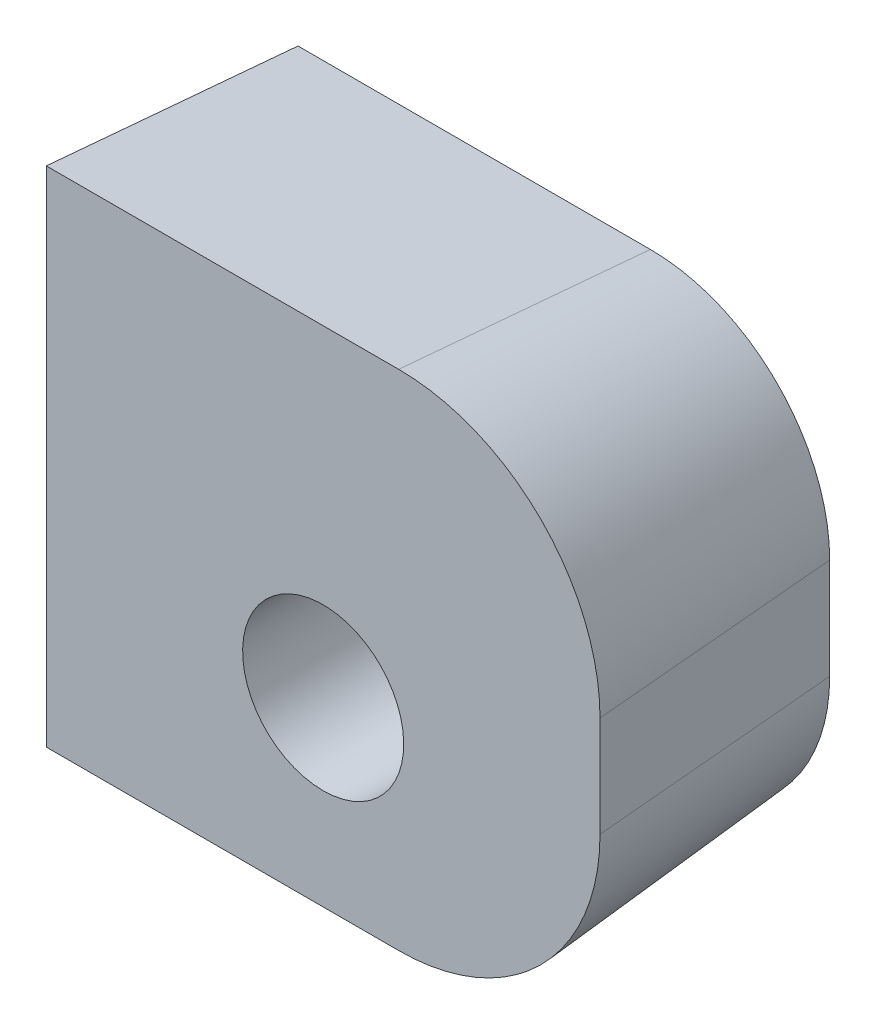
ISO-10303-21;
HEADER;
FILE_DESCRIPTION(('STEP AP214'),'2;1');
FILE_NAME('part.step','',(''),(''),'','','');
FILE_SCHEMA(('AUTOMOTIVE_DESIGN { 1 0 10303 214 1 1 1 1 }'));
ENDSEC;
DATA;
#1=APPLICATION_CONTEXT('core data for automotive mechanical design processes');
#2=APPLICATION_PROTOCOL_DEFINITION('international standard','automotive_design',2000,#1);
#3=PRODUCT_CONTEXT('',#1,'mechanical');
#4=PRODUCT('Part','Part','',(#3));
#5=PRODUCT_RELATED_PRODUCT_CATEGORY('part','',(#4));
#6=PRODUCT_DEFINITION_FORMATION('','',#4);
#7=PRODUCT_DEFINITION_CONTEXT('part definition',#1,'design');
#8=PRODUCT_DEFINITION('design','',#6,#7);
#9=PRODUCT_DEFINITION_SHAPE('','',#8);
#10=(LENGTH_UNIT() NAMED_UNIT(*) SI_UNIT(.MILLI.,.METRE.));
#11=(NAMED_UNIT(*) PLANE_ANGLE_UNIT() SI_UNIT($,.RADIAN.));
#12=(NAMED_UNIT(*) SI_UNIT($,.STERADIAN.) SOLID_ANGLE_UNIT());
#13=UNCERTAINTY_MEASURE_WITH_UNIT(LENGTH_MEASURE(1.E-05),#10,'distance_accuracy_value','');
#14=(GEOMETRIC_REPRESENTATION_CONTEXT(3) GLOBAL_UNCERTAINTY_ASSIGNED_CONTEXT((#13)) GLOBAL_UNIT_ASSIGNED_CONTEXT((#10,
#11,#12)) REPRESENTATION_CONTEXT('',''));
#15=CARTESIAN_POINT('',(0.,0.,0.));
#16=DIRECTION('',(0.,0.,1.));
#17=DIRECTION('',(1.,0.,0.));
#18=AXIS2_PLACEMENT_3D('',#15,#16,#17);
#19=CARTESIAN_POINT('',(-25.1242782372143,20.1001640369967,-2.51250000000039));
#20=DIRECTION('',(0.,0.,-1.));
#21=DIRECTION('',(-1.,0.,0.));
#22=AXIS2_PLACEMENT_3D('',#19,#20,#21);
#23=PLANE('',#22);
#24=DIRECTION('',(0.,1.,0.));
#25=VECTOR('',#24,1.);
#26=CARTESIAN_POINT('',(-19.8165935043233,20.1001640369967,-2.51250000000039));
#27=LINE('',#26,#25);
#28=CARTESIAN_POINT('',(-19.8165935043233,23.1151640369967,-2.51250000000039));
#29=VERTEX_POINT('',#28);
#30=CARTESIAN_POINT('',(-19.8165935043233,22.1101640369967,-2.51250000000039));
#31=VERTEX_POINT('',#30);
#32=EDGE_CURVE('E109',#29,#31,#27,.F.);
#33=ORIENTED_EDGE('',*,*,#32,.T.);
#34=CARTESIAN_POINT('',(-21.6067782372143,22.1101640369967,-2.51250000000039));
#35=DIRECTION('',(0.,0.,-1.));
#36=DIRECTION('',(0.,-1.,0.));
#37=AXIS2_PLACEMENT_3D('',#34,#35,#36);
#38=CIRCLE('',#37,1.79018473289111);
#39=CARTESIAN_POINT('',(-21.6067782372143,20.3199793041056,-2.51250000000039));
#40=VERTEX_POINT('',#39);
#41=EDGE_CURVE('E104',#31,#40,#38,.T.);
#42=ORIENTED_EDGE('',*,*,#41,.T.);
#43=DIRECTION('',(1.,0.,0.));
#44=VECTOR('',#43,1.);
#45=CARTESIAN_POINT('',(-25.1242782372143,20.3199793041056,-2.51250000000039));
#46=LINE('',#45,#44);
#47=CARTESIAN_POINT('',(-25.1242782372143,20.3199793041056,-2.51250000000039));
#48=VERTEX_POINT('',#47);
#49=EDGE_CURVE('E108',#40,#48,#46,.F.);
#50=ORIENTED_EDGE('',*,*,#49,.T.);
#51=DIRECTION('',(0.,1.,0.));
#52=VECTOR('',#51,1.);
#53=CARTESIAN_POINT('',(-25.1242782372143,20.1001640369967,-2.51250000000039));
#54=LINE('',#53,#52);
#55=CARTESIAN_POINT('',(-25.1242782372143,24.9053487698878,-2.51250000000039));
#56=VERTEX_POINT('',#55);
#57=EDGE_CURVE('E117',#48,#56,#54,.T.);
#58=ORIENTED_EDGE('',*,*,#57,.T.);
#59=DIRECTION('',(-1.,0.,0.));
#60=VECTOR('',#59,1.);
#61=CARTESIAN_POINT('',(-25.1242782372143,24.9053487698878,-2.51250000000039));
#62=LINE('',#61,#60);
#63=CARTESIAN_POINT('',(-21.6067782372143,24.9053487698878,-2.51250000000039));
#64=VERTEX_POINT('',#63);
#65=EDGE_CURVE('E115',#56,#64,#62,.F.);
#66=ORIENTED_EDGE('',*,*,#65,.T.);
#67=CARTESIAN_POINT('',(-21.6067782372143,23.1151640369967,-2.51250000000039));
#68=DIRECTION('',(0.,0.,-1.));
#69=DIRECTION('',(0.,-1.,0.));
#70=AXIS2_PLACEMENT_3D('',#67,#68,#69);
#71=CIRCLE('',#70,1.79018473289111);
#72=EDGE_CURVE('E87',#64,#29,#71,.T.);
#73=ORIENTED_EDGE('',*,*,#72,.T.);
#74=EDGE_LOOP('',(#33,#42,#50,#58,#66,#73));
#75=FACE_BOUND('',#74,.T.);
#76=CARTESIAN_POINT('',(-22.3605282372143,21.9091640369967,-2.51250000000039));
#77=DIRECTION('',(0.,0.,-1.));
#78=DIRECTION('',(0.,-1.,0.));
#79=AXIS2_PLACEMENT_3D('',#76,#77,#78);
#80=CIRCLE('',#79,0.804);
#81=CARTESIAN_POINT('',(-22.3605282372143,21.1051640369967,-2.51250000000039));
#82=VERTEX_POINT('',#81);
#83=EDGE_CURVE('E20',#82,#82,#80,.F.);
#84=ORIENTED_EDGE('',*,*,#83,.T.);
#85=EDGE_LOOP('',(#84));
#86=FACE_BOUND('',#85,.T.);
#87=ADVANCED_FACE('F16',(#75,#86),#23,.T.);
#88=CARTESIAN_POINT('',(-25.1242782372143,20.1001640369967,-3.92264346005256E-13));
#89=DIRECTION('',(0.,0.,-1.));
#90=DIRECTION('',(-1.,0.,0.));
#91=AXIS2_PLACEMENT_3D('',#88,#89,#90);
#92=PLANE('',#91);
#93=DIRECTION('',(1.,0.,0.));
#94=VECTOR('',#93,1.);
#95=CARTESIAN_POINT('',(-25.1242782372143,20.1001640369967,-3.92264346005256E-13));
#96=LINE('',#95,#94);
#97=CARTESIAN_POINT('',(-21.6067782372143,20.1001640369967,-3.92264346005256E-13));
#98=VERTEX_POINT('',#97);
#99=CARTESIAN_POINT('',(-25.1242782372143,20.1001640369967,-3.92264346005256E-13));
#100=VERTEX_POINT('',#99);
#101=EDGE_CURVE('E55',#98,#100,#96,.F.);
#102=ORIENTED_EDGE('',*,*,#101,.F.);
#103=CARTESIAN_POINT('',(-21.6067782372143,22.1101640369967,-3.92264346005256E-13));
#104=DIRECTION('',(0.,0.,-1.));
#105=DIRECTION('',(0.,-1.,0.));
#106=AXIS2_PLACEMENT_3D('',#103,#104,#105);
#107=CIRCLE('',#106,2.01);
#108=CARTESIAN_POINT('',(-19.5967782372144,22.1101640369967,-3.92264346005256E-13));
#109=VERTEX_POINT('',#108);
#110=EDGE_CURVE('E70',#98,#109,#107,.F.);
#111=ORIENTED_EDGE('',*,*,#110,.T.);
#112=DIRECTION('',(0.,1.,0.));
#113=VECTOR('',#112,1.);
#114=CARTESIAN_POINT('',(-19.5967782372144,20.1001640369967,-3.92264346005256E-13));
#115=LINE('',#114,#113);
#116=CARTESIAN_POINT('',(-19.5967782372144,23.1151640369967,-3.92264346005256E-13));
#117=VERTEX_POINT('',#116);
#118=EDGE_CURVE('E67',#117,#109,#115,.F.);
#119=ORIENTED_EDGE('',*,*,#118,.F.);
#120=CARTESIAN_POINT('',(-21.6067782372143,23.1151640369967,-3.92264346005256E-13));
#121=DIRECTION('',(0.,0.,-1.));
#122=DIRECTION('',(0.,-1.,0.));
#123=AXIS2_PLACEMENT_3D('',#120,#121,#122);
#124=CIRCLE('',#123,2.01);
#125=CARTESIAN_POINT('',(-21.6067782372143,25.1251640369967,-3.92264346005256E-13));
#126=VERTEX_POINT('',#125);
#127=EDGE_CURVE('E36',#117,#126,#124,.F.);
#128=ORIENTED_EDGE('',*,*,#127,.T.);
#129=DIRECTION('',(-1.,0.,0.));
#130=VECTOR('',#129,1.);
#131=CARTESIAN_POINT('',(-25.1242782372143,25.1251640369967,-3.92264346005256E-13));
#132=LINE('',#131,#130);
#133=CARTESIAN_POINT('',(-25.1242782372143,25.1251640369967,-3.92264346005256E-13));
#134=VERTEX_POINT('',#133);
#135=EDGE_CURVE('E65',#134,#126,#132,.F.);
#136=ORIENTED_EDGE('',*,*,#135,.F.);
#137=DIRECTION('',(0.,1.,0.));
#138=VECTOR('',#137,1.);
#139=CARTESIAN_POINT('',(-25.1242782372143,20.1001640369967,-3.92264346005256E-13));
#140=LINE('',#139,#138);
#141=EDGE_CURVE('E123',#100,#134,#140,.T.);
#142=ORIENTED_EDGE('',*,*,#141,.F.);
#143=EDGE_LOOP('',(#102,#111,#119,#128,#136,#142));
#144=FACE_BOUND('',#143,.T.);
#145=CARTESIAN_POINT('',(-22.3605282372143,21.9091640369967,-3.88777551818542E-13));
#146=DIRECTION('',(0.,0.,-1.));
#147=DIRECTION('',(0.,-1.,0.));
#148=AXIS2_PLACEMENT_3D('',#145,#146,#147);
#149=CIRCLE('',#148,0.804);
#150=CARTESIAN_POINT('',(-22.3605282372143,21.1051640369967,-3.88777551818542E-13));
#151=VERTEX_POINT('',#150);
#152=EDGE_CURVE('E11',#151,#151,#149,.F.);
#153=ORIENTED_EDGE('',*,*,#152,.F.);
#154=EDGE_LOOP('',(#153));
#155=FACE_BOUND('',#154,.T.);
#156=ADVANCED_FACE('F63',(#144,#155),#92,.F.);
#157=CARTESIAN_POINT('',(-25.1242782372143,20.1001640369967,-3.92264346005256E-13));
#158=DIRECTION('',(0.,-0.996194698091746,-0.0871557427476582));
#159=DIRECTION('',(0.,-0.0871557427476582,0.996194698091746));
#160=AXIS2_PLACEMENT_3D('',#157,#158,#159);
#161=PLANE('',#160);
#162=ORIENTED_EDGE('',*,*,#49,.F.);
#163=DIRECTION('',(0.,-0.0871557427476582,0.996194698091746));
#164=VECTOR('',#163,1.);
#165=CARTESIAN_POINT('',(-21.6067782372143,20.1001640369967,-3.92264346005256E-13));
#166=LINE('',#165,#164);
#167=EDGE_CURVE('E69',#40,#98,#166,.T.);
#168=ORIENTED_EDGE('',*,*,#167,.T.);
#169=ORIENTED_EDGE('',*,*,#101,.T.);
#170=DIRECTION('',(0.,0.0871557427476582,-0.996194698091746));
#171=VECTOR('',#170,1.);
#172=CARTESIAN_POINT('',(-25.1242782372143,20.3183095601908,-2.49341473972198));
#173=LINE('',#172,#171);
#174=EDGE_CURVE('E82',#48,#100,#173,.F.);
#175=ORIENTED_EDGE('',*,*,#174,.F.);
#176=EDGE_LOOP('',(#162,#168,#169,#175));
#177=FACE_BOUND('',#176,.T.);
#178=ADVANCED_FACE('F164',(#177),#161,.T.);
#179=CARTESIAN_POINT('',(-25.1242782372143,20.1001640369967,-2.51250000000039));
#180=DIRECTION('',(1.,0.,0.));
#181=DIRECTION('',(0.,-1.,0.));
#182=AXIS2_PLACEMENT_3D('',#179,#180,#181);
#183=PLANE('',#182);
#184=ORIENTED_EDGE('',*,*,#141,.T.);
#185=DIRECTION('',(0.,-0.0871557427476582,-0.996194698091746));
#186=VECTOR('',#185,1.);
#187=CARTESIAN_POINT('',(-25.1242782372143,25.1251640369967,-3.92264346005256E-13));
#188=LINE('',#187,#186);
#189=EDGE_CURVE('E80',#56,#134,#188,.F.);
#190=ORIENTED_EDGE('',*,*,#189,.F.);
#191=ORIENTED_EDGE('',*,*,#57,.F.);
#192=ORIENTED_EDGE('',*,*,#174,.T.);
#193=EDGE_LOOP('',(#184,#190,#191,#192));
#194=FACE_BOUND('',#193,.T.);
#195=ADVANCED_FACE('F147',(#194),#183,.F.);
#196=CARTESIAN_POINT('',(-25.1242782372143,25.1251640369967,-3.92264346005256E-13));
#197=DIRECTION('',(0.,0.996194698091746,-0.0871557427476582));
#198=DIRECTION('',(0.,-0.0871557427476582,-0.996194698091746));
#199=AXIS2_PLACEMENT_3D('',#196,#197,#198);
#200=PLANE('',#199);
#201=ORIENTED_EDGE('',*,*,#135,.T.);
#202=DIRECTION('',(0.,0.0871557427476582,0.996194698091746));
#203=VECTOR('',#202,1.);
#204=CARTESIAN_POINT('',(-21.6067782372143,25.1251640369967,-3.92264346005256E-13));
#205=LINE('',#204,#203);
#206=EDGE_CURVE('E77',#126,#64,#205,.F.);
#207=ORIENTED_EDGE('',*,*,#206,.T.);
#208=ORIENTED_EDGE('',*,*,#65,.F.);
#209=ORIENTED_EDGE('',*,*,#189,.T.);
#210=EDGE_LOOP('',(#201,#207,#208,#209));
#211=FACE_BOUND('',#210,.T.);
#212=ADVANCED_FACE('F75',(#211),#200,.T.);
#213=CARTESIAN_POINT('',(-19.5967782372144,20.1001640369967,-3.92264346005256E-13));
#214=DIRECTION('',(0.996194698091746,0.,-0.0871557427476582));
#215=DIRECTION('',(-0.0871557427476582,0.,-0.996194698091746));
#216=AXIS2_PLACEMENT_3D('',#213,#214,#215);
#217=PLANE('',#216);
#218=ORIENTED_EDGE('',*,*,#118,.T.);
#219=DIRECTION('',(0.0871557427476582,0.,0.996194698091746));
#220=VECTOR('',#219,1.);
#221=CARTESIAN_POINT('',(-19.5967782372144,22.1101640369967,-3.92294983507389E-13));
#222=LINE('',#221,#220);
#223=EDGE_CURVE('E101',#109,#31,#222,.F.);
#224=ORIENTED_EDGE('',*,*,#223,.T.);
#225=ORIENTED_EDGE('',*,*,#32,.F.);
#226=DIRECTION('',(0.0871557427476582,0.,0.996194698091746));
#227=VECTOR('',#226,1.);
#228=CARTESIAN_POINT('',(-19.5967782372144,23.1151640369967,-3.92310302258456E-13));
#229=LINE('',#228,#227);
#230=EDGE_CURVE('E27',#29,#117,#229,.T.);
#231=ORIENTED_EDGE('',*,*,#230,.T.);
#232=EDGE_LOOP('',(#218,#224,#225,#231));
#233=FACE_BOUND('',#232,.T.);
#234=ADVANCED_FACE('F154',(#233),#217,.T.);
#235=CARTESIAN_POINT('',(-21.6067782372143,22.1101640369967,-3.92264346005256E-13));
#236=DIRECTION('',(0.,0.,1.));
#237=DIRECTION('',(0.,-1.,0.));
#238=AXIS2_PLACEMENT_3D('',#235,#236,#237);
#239=CONICAL_SURFACE('',#238,2.01,0.0872664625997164);
#240=ORIENTED_EDGE('',*,*,#41,.F.);
#241=ORIENTED_EDGE('',*,*,#223,.F.);
#242=ORIENTED_EDGE('',*,*,#110,.F.);
#243=ORIENTED_EDGE('',*,*,#167,.F.);
#244=EDGE_LOOP('',(#240,#241,#242,#243));
#245=FACE_BOUND('',#244,.T.);
#246=ADVANCED_FACE('F157',(#245),#239,.T.);
#247=CARTESIAN_POINT('',(-21.6067782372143,23.1151640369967,-3.92264346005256E-13));
#248=DIRECTION('',(0.,0.,1.));
#249=DIRECTION('',(0.,-1.,0.));
#250=AXIS2_PLACEMENT_3D('',#247,#248,#249);
#251=CONICAL_SURFACE('',#250,2.01,0.0872664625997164);
#252=ORIENTED_EDGE('',*,*,#72,.F.);
#253=ORIENTED_EDGE('',*,*,#206,.F.);
#254=ORIENTED_EDGE('',*,*,#127,.F.);
#255=ORIENTED_EDGE('',*,*,#230,.F.);
#256=EDGE_LOOP('',(#252,#253,#254,#255));
#257=FACE_BOUND('',#256,.T.);
#258=ADVANCED_FACE('F85',(#257),#251,.T.);
#259=CARTESIAN_POINT('',(-22.3605282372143,21.9091640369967,43.9220645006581));
#260=DIRECTION('',(0.,0.,-1.));
#261=DIRECTION('',(-1.,0.,0.));
#262=AXIS2_PLACEMENT_3D('',#259,#260,#261);
#263=CYLINDRICAL_SURFACE('',#262,0.804);
#264=ORIENTED_EDGE('',*,*,#83,.F.);
#265=EDGE_LOOP('',(#264));
#266=FACE_BOUND('',#265,.T.);
#267=ORIENTED_EDGE('',*,*,#152,.T.);
#268=EDGE_LOOP('',(#267));
#269=FACE_BOUND('',#268,.T.);
#270=ADVANCED_FACE('F18',(#266,#269),#263,.F.);
#271=CLOSED_SHELL('',(#87,#156,#178,#195,#212,#234,#246,#258,#270));
#272=MANIFOLD_SOLID_BREP('B1',#271);
#273=ADVANCED_BREP_SHAPE_REPRESENTATION('',(#18,#272),#14);
#274=SHAPE_DEFINITION_REPRESENTATION(#9,#273);
ENDSEC;
END-ISO-10303-21;
